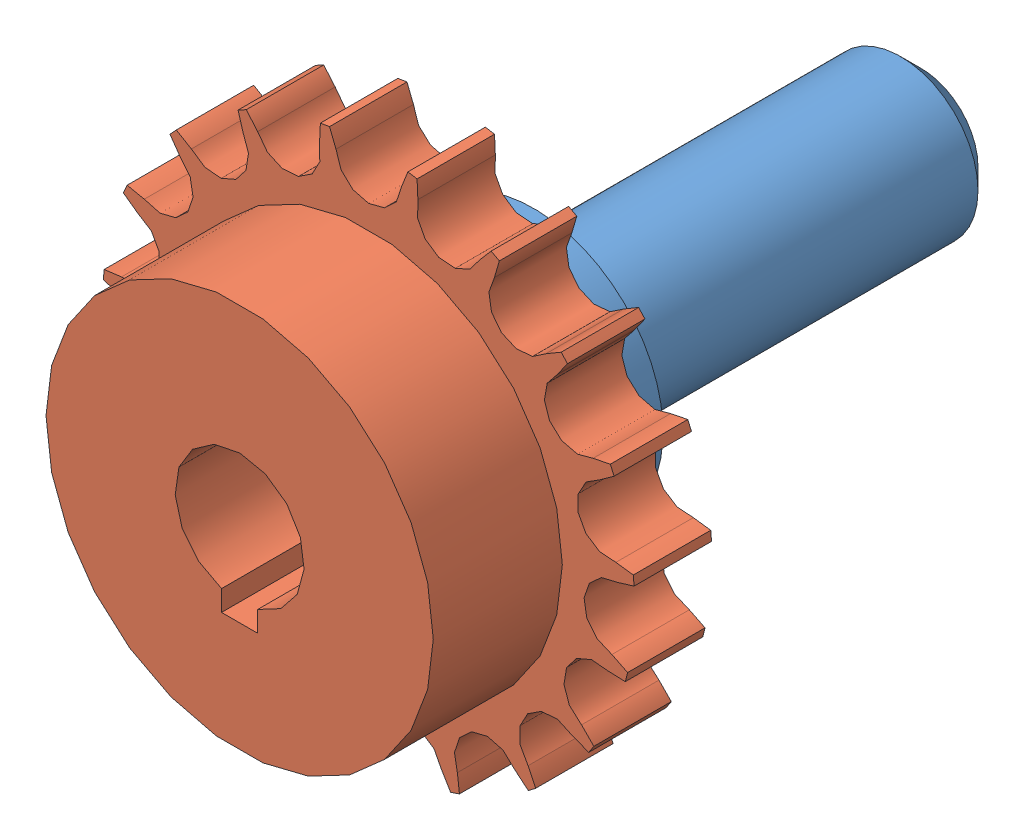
SolidWorks assembly arbre-pignon moteur.SLDASM, configuration Défaut (file format 3100). Lengths in mm.
Overall size (102.78 102.44 132).
2 component instances, 2 part files, 2 mates.
Components (placement in the parent):
- arbre mot-1: arbre mot.SLDPRT [Défaut] at (-1.2183 -63.5554 26.5) size (50 50 97)
- pignon moteur-1: pignon moteur.SLDPRT [Défaut] at (-1.2183 -63.5554 43.5) size (102.78 102.44 40)
Mates (geometry in assembly coordinates):
- Coïncidente1: coincident anti-aligned: plane of arbre mot-1 through (-1.2183 -63.5554 48.5) normal (0 0 1); plane of pignon moteur-1 through (-1.2183 -63.5554 48.5) normal (0 0 -1)
- Coaxial1: concentric aligned: cylinder of arbre mot-1; cylinder of pignon moteur-1
